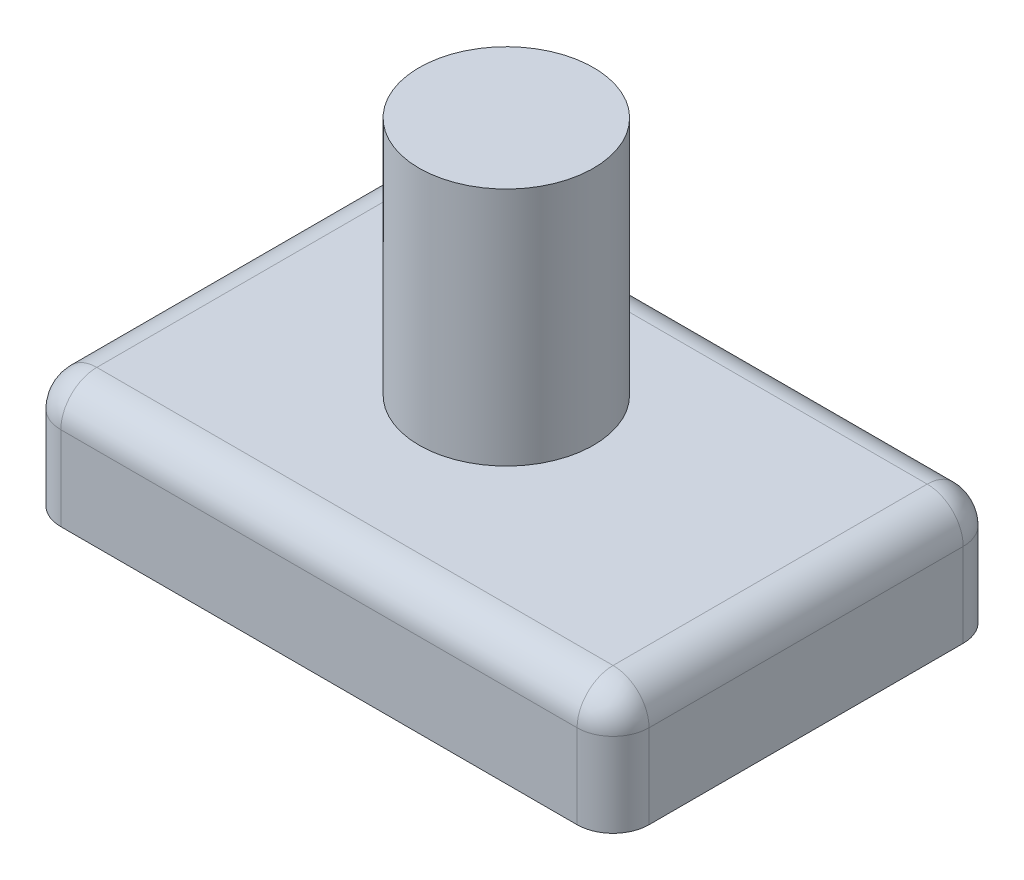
ISO-10303-21;
HEADER;
FILE_DESCRIPTION(('STEP AP214'),'2;1');
FILE_NAME('part.step','',(''),(''),'','','');
FILE_SCHEMA(('AUTOMOTIVE_DESIGN { 1 0 10303 214 1 1 1 1 }'));
ENDSEC;
DATA;
#1=APPLICATION_CONTEXT('core data for automotive mechanical design processes');
#2=APPLICATION_PROTOCOL_DEFINITION('international standard','automotive_design',2000,#1);
#3=PRODUCT_CONTEXT('',#1,'mechanical');
#4=PRODUCT('Part','Part','',(#3));
#5=PRODUCT_RELATED_PRODUCT_CATEGORY('part','',(#4));
#6=PRODUCT_DEFINITION_FORMATION('','',#4);
#7=PRODUCT_DEFINITION_CONTEXT('part definition',#1,'design');
#8=PRODUCT_DEFINITION('design','',#6,#7);
#9=PRODUCT_DEFINITION_SHAPE('','',#8);
#10=(LENGTH_UNIT() NAMED_UNIT(*) SI_UNIT(.MILLI.,.METRE.));
#11=(NAMED_UNIT(*) PLANE_ANGLE_UNIT() SI_UNIT($,.RADIAN.));
#12=(NAMED_UNIT(*) SI_UNIT($,.STERADIAN.) SOLID_ANGLE_UNIT());
#13=UNCERTAINTY_MEASURE_WITH_UNIT(LENGTH_MEASURE(1.E-05),#10,'distance_accuracy_value','');
#14=(GEOMETRIC_REPRESENTATION_CONTEXT(3) GLOBAL_UNCERTAINTY_ASSIGNED_CONTEXT((#13)) GLOBAL_UNIT_ASSIGNED_CONTEXT((#10,
#11,#12)) REPRESENTATION_CONTEXT('',''));
#15=CARTESIAN_POINT('',(0.,0.,0.));
#16=DIRECTION('',(0.,0.,1.));
#17=DIRECTION('',(1.,0.,0.));
#18=AXIS2_PLACEMENT_3D('',#15,#16,#17);
#19=CARTESIAN_POINT('',(-56.0242685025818,25.4,45.9254733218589));
#20=DIRECTION('',(0.,1.,0.));
#21=DIRECTION('',(0.,0.,1.));
#22=AXIS2_PLACEMENT_3D('',#19,#20,#21);
#23=PLANE('',#22);
#24=DIRECTION('',(-1.,0.,0.));
#25=VECTOR('',#24,1.);
#26=CARTESIAN_POINT('',(-48.4042685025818,25.4,-28.206678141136));
#27=LINE('',#26,#25);
#28=CARTESIAN_POINT('',(60.9075387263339,25.4,-28.206678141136));
#29=VERTEX_POINT('',#28);
#30=CARTESIAN_POINT('',(-48.4042685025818,25.4,-28.206678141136));
#31=VERTEX_POINT('',#30);
#32=EDGE_CURVE('E166',#29,#31,#27,.T.);
#33=ORIENTED_EDGE('',*,*,#32,.T.);
#34=DIRECTION('',(0.,0.,1.));
#35=VECTOR('',#34,1.);
#36=CARTESIAN_POINT('',(-48.4042685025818,25.4,38.3054733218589));
#37=LINE('',#36,#35);
#38=CARTESIAN_POINT('',(-48.4042685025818,25.4,38.3054733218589));
#39=VERTEX_POINT('',#38);
#40=EDGE_CURVE('E168',#31,#39,#37,.T.);
#41=ORIENTED_EDGE('',*,*,#40,.T.);
#42=DIRECTION('',(1.,0.,0.));
#43=VECTOR('',#42,1.);
#44=CARTESIAN_POINT('',(60.9075387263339,25.4,38.3054733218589));
#45=LINE('',#44,#43);
#46=CARTESIAN_POINT('',(60.9075387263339,25.4,38.3054733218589));
#47=VERTEX_POINT('',#46);
#48=EDGE_CURVE('E162',#39,#47,#45,.T.);
#49=ORIENTED_EDGE('',*,*,#48,.T.);
#50=DIRECTION('',(0.,0.,-1.));
#51=VECTOR('',#50,1.);
#52=CARTESIAN_POINT('',(60.9075387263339,25.4,-28.206678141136));
#53=LINE('',#52,#51);
#54=EDGE_CURVE('E164',#47,#29,#53,.T.);
#55=ORIENTED_EDGE('',*,*,#54,.T.);
#56=EDGE_LOOP('',(#33,#41,#49,#55));
#57=FACE_BOUND('',#56,.T.);
#58=CARTESIAN_POINT('',(0.,25.4,0.));
#59=DIRECTION('',(0.,1.,0.));
#60=DIRECTION('',(0.,0.,1.));
#61=AXIS2_PLACEMENT_3D('',#58,#59,#60);
#62=CIRCLE('',#61,18.4625705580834);
#63=CARTESIAN_POINT('',(0.,25.4,18.4625705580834));
#64=VERTEX_POINT('',#63);
#65=EDGE_CURVE('E246',#64,#64,#62,.T.);
#66=ORIENTED_EDGE('',*,*,#65,.F.);
#67=EDGE_LOOP('',(#66));
#68=FACE_BOUND('',#67,.T.);
#69=ADVANCED_FACE('F33',(#57,#68),#23,.T.);
#70=CARTESIAN_POINT('',(-56.0242685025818,25.4,-35.826678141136));
#71=DIRECTION('',(1.,0.,0.));
#72=DIRECTION('',(0.,0.,-1.));
#73=AXIS2_PLACEMENT_3D('',#70,#71,#72);
#74=PLANE('',#73);
#75=DIRECTION('',(0.,-1.,0.));
#76=VECTOR('',#75,1.);
#77=CARTESIAN_POINT('',(-56.0242685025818,25.4,38.3054733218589));
#78=LINE('',#77,#76);
#79=CARTESIAN_POINT('',(-56.0242685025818,0.,38.3054733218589));
#80=VERTEX_POINT('',#79);
#81=CARTESIAN_POINT('',(-56.0242685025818,17.78,38.3054733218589));
#82=VERTEX_POINT('',#81);
#83=EDGE_CURVE('E154',#80,#82,#78,.F.);
#84=ORIENTED_EDGE('',*,*,#83,.T.);
#85=DIRECTION('',(0.,0.,1.));
#86=VECTOR('',#85,1.);
#87=CARTESIAN_POINT('',(-56.0242685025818,17.78,-28.206678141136));
#88=LINE('',#87,#86);
#89=CARTESIAN_POINT('',(-56.0242685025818,17.78,-28.206678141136));
#90=VERTEX_POINT('',#89);
#91=EDGE_CURVE('E171',#82,#90,#88,.F.);
#92=ORIENTED_EDGE('',*,*,#91,.T.);
#93=DIRECTION('',(0.,-1.,0.));
#94=VECTOR('',#93,1.);
#95=CARTESIAN_POINT('',(-56.0242685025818,25.4,-28.206678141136));
#96=LINE('',#95,#94);
#97=CARTESIAN_POINT('',(-56.0242685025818,0.,-28.206678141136));
#98=VERTEX_POINT('',#97);
#99=EDGE_CURVE('E157',#90,#98,#96,.T.);
#100=ORIENTED_EDGE('',*,*,#99,.T.);
#101=DIRECTION('',(0.,0.,1.));
#102=VECTOR('',#101,1.);
#103=CARTESIAN_POINT('',(-56.0242685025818,0.,-35.826678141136));
#104=LINE('',#103,#102);
#105=EDGE_CURVE('E252',#98,#80,#104,.T.);
#106=ORIENTED_EDGE('',*,*,#105,.T.);
#107=EDGE_LOOP('',(#84,#92,#100,#106));
#108=FACE_BOUND('',#107,.T.);
#109=ADVANCED_FACE('F35',(#108),#74,.F.);
#110=CARTESIAN_POINT('',(-56.0242685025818,25.4,45.9254733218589));
#111=DIRECTION('',(0.,0.,-1.));
#112=DIRECTION('',(-1.,0.,0.));
#113=AXIS2_PLACEMENT_3D('',#110,#111,#112);
#114=PLANE('',#113);
#115=DIRECTION('',(0.,-1.,0.));
#116=VECTOR('',#115,1.);
#117=CARTESIAN_POINT('',(60.9075387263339,25.4,45.9254733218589));
#118=LINE('',#117,#116);
#119=CARTESIAN_POINT('',(60.9075387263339,0.,45.9254733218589));
#120=VERTEX_POINT('',#119);
#121=CARTESIAN_POINT('',(60.9075387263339,17.78,45.9254733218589));
#122=VERTEX_POINT('',#121);
#123=EDGE_CURVE('E152',#120,#122,#118,.F.);
#124=ORIENTED_EDGE('',*,*,#123,.T.);
#125=DIRECTION('',(1.,0.,0.));
#126=VECTOR('',#125,1.);
#127=CARTESIAN_POINT('',(-48.4042685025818,17.78,45.9254733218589));
#128=LINE('',#127,#126);
#129=CARTESIAN_POINT('',(-48.4042685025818,17.78,45.9254733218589));
#130=VERTEX_POINT('',#129);
#131=EDGE_CURVE('E11',#122,#130,#128,.F.);
#132=ORIENTED_EDGE('',*,*,#131,.T.);
#133=DIRECTION('',(0.,-1.,0.));
#134=VECTOR('',#133,1.);
#135=CARTESIAN_POINT('',(-48.4042685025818,25.4,45.9254733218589));
#136=LINE('',#135,#134);
#137=CARTESIAN_POINT('',(-48.4042685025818,0.,45.9254733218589));
#138=VERTEX_POINT('',#137);
#139=EDGE_CURVE('E150',#130,#138,#136,.T.);
#140=ORIENTED_EDGE('',*,*,#139,.T.);
#141=DIRECTION('',(1.,0.,0.));
#142=VECTOR('',#141,1.);
#143=CARTESIAN_POINT('',(-56.0242685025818,0.,45.9254733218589));
#144=LINE('',#143,#142);
#145=EDGE_CURVE('E141',#138,#120,#144,.T.);
#146=ORIENTED_EDGE('',*,*,#145,.T.);
#147=EDGE_LOOP('',(#124,#132,#140,#146));
#148=FACE_BOUND('',#147,.T.);
#149=ADVANCED_FACE('F213',(#148),#114,.F.);
#150=CARTESIAN_POINT('',(68.5275387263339,25.4,-35.826678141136));
#151=DIRECTION('',(-1.,0.,0.));
#152=DIRECTION('',(0.,0.,1.));
#153=AXIS2_PLACEMENT_3D('',#150,#151,#152);
#154=PLANE('',#153);
#155=DIRECTION('',(0.,-1.,0.));
#156=VECTOR('',#155,1.);
#157=CARTESIAN_POINT('',(68.5275387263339,25.4,-28.206678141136));
#158=LINE('',#157,#156);
#159=CARTESIAN_POINT('',(68.5275387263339,0.,-28.206678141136));
#160=VERTEX_POINT('',#159);
#161=CARTESIAN_POINT('',(68.5275387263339,17.78,-28.206678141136));
#162=VERTEX_POINT('',#161);
#163=EDGE_CURVE('E127',#160,#162,#158,.F.);
#164=ORIENTED_EDGE('',*,*,#163,.T.);
#165=DIRECTION('',(0.,0.,-1.));
#166=VECTOR('',#165,1.);
#167=CARTESIAN_POINT('',(68.5275387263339,17.78,38.3054733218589));
#168=LINE('',#167,#166);
#169=CARTESIAN_POINT('',(68.5275387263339,17.78,38.3054733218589));
#170=VERTEX_POINT('',#169);
#171=EDGE_CURVE('E55',#162,#170,#168,.F.);
#172=ORIENTED_EDGE('',*,*,#171,.T.);
#173=DIRECTION('',(0.,-1.,0.));
#174=VECTOR('',#173,1.);
#175=CARTESIAN_POINT('',(68.5275387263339,25.4,38.3054733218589));
#176=LINE('',#175,#174);
#177=CARTESIAN_POINT('',(68.5275387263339,0.,38.3054733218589));
#178=VERTEX_POINT('',#177);
#179=EDGE_CURVE('E131',#170,#178,#176,.T.);
#180=ORIENTED_EDGE('',*,*,#179,.T.);
#181=DIRECTION('',(0.,0.,-1.));
#182=VECTOR('',#181,1.);
#183=CARTESIAN_POINT('',(68.5275387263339,0.,-35.826678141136));
#184=LINE('',#183,#182);
#185=EDGE_CURVE('E138',#178,#160,#184,.T.);
#186=ORIENTED_EDGE('',*,*,#185,.T.);
#187=EDGE_LOOP('',(#164,#172,#180,#186));
#188=FACE_BOUND('',#187,.T.);
#189=ADVANCED_FACE('F182',(#188),#154,.F.);
#190=CARTESIAN_POINT('',(-56.0242685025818,25.4,-35.826678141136));
#191=DIRECTION('',(0.,0.,1.));
#192=DIRECTION('',(1.,0.,0.));
#193=AXIS2_PLACEMENT_3D('',#190,#191,#192);
#194=PLANE('',#193);
#195=DIRECTION('',(0.,-1.,0.));
#196=VECTOR('',#195,1.);
#197=CARTESIAN_POINT('',(-48.4042685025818,25.4,-35.826678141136));
#198=LINE('',#197,#196);
#199=CARTESIAN_POINT('',(-48.4042685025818,0.,-35.826678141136));
#200=VERTEX_POINT('',#199);
#201=CARTESIAN_POINT('',(-48.4042685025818,17.78,-35.826678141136));
#202=VERTEX_POINT('',#201);
#203=EDGE_CURVE('E122',#200,#202,#198,.F.);
#204=ORIENTED_EDGE('',*,*,#203,.T.);
#205=DIRECTION('',(-1.,0.,0.));
#206=VECTOR('',#205,1.);
#207=CARTESIAN_POINT('',(60.9075387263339,17.78,-35.826678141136));
#208=LINE('',#207,#206);
#209=CARTESIAN_POINT('',(60.9075387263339,17.78,-35.826678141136));
#210=VERTEX_POINT('',#209);
#211=EDGE_CURVE('E118',#202,#210,#208,.F.);
#212=ORIENTED_EDGE('',*,*,#211,.T.);
#213=DIRECTION('',(0.,-1.,0.));
#214=VECTOR('',#213,1.);
#215=CARTESIAN_POINT('',(60.9075387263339,25.4,-35.826678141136));
#216=LINE('',#215,#214);
#217=CARTESIAN_POINT('',(60.9075387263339,0.,-35.826678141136));
#218=VERTEX_POINT('',#217);
#219=EDGE_CURVE('E110',#210,#218,#216,.T.);
#220=ORIENTED_EDGE('',*,*,#219,.T.);
#221=DIRECTION('',(-1.,0.,0.));
#222=VECTOR('',#221,1.);
#223=CARTESIAN_POINT('',(-56.0242685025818,0.,-35.826678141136));
#224=LINE('',#223,#222);
#225=EDGE_CURVE('E115',#218,#200,#224,.T.);
#226=ORIENTED_EDGE('',*,*,#225,.T.);
#227=EDGE_LOOP('',(#204,#212,#220,#226));
#228=FACE_BOUND('',#227,.T.);
#229=ADVANCED_FACE('F113',(#228),#194,.F.);
#230=CARTESIAN_POINT('',(-56.0242685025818,0.,45.9254733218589));
#231=DIRECTION('',(0.,1.,0.));
#232=DIRECTION('',(0.,0.,1.));
#233=AXIS2_PLACEMENT_3D('',#230,#231,#232);
#234=PLANE('',#233);
#235=ORIENTED_EDGE('',*,*,#225,.F.);
#236=CARTESIAN_POINT('',(60.9075387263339,0.,-28.206678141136));
#237=DIRECTION('',(0.,1.,0.));
#238=DIRECTION('',(0.,0.,1.));
#239=AXIS2_PLACEMENT_3D('',#236,#237,#238);
#240=CIRCLE('',#239,7.62);
#241=EDGE_CURVE('E125',#218,#160,#240,.F.);
#242=ORIENTED_EDGE('',*,*,#241,.T.);
#243=ORIENTED_EDGE('',*,*,#185,.F.);
#244=CARTESIAN_POINT('',(60.9075387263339,0.,38.3054733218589));
#245=DIRECTION('',(0.,1.,0.));
#246=DIRECTION('',(0.,0.,1.));
#247=AXIS2_PLACEMENT_3D('',#244,#245,#246);
#248=CIRCLE('',#247,7.62);
#249=EDGE_CURVE('E132',#178,#120,#248,.F.);
#250=ORIENTED_EDGE('',*,*,#249,.T.);
#251=ORIENTED_EDGE('',*,*,#145,.F.);
#252=CARTESIAN_POINT('',(-48.4042685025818,0.,38.3054733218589));
#253=DIRECTION('',(0.,1.,0.));
#254=DIRECTION('',(0.,0.,1.));
#255=AXIS2_PLACEMENT_3D('',#252,#253,#254);
#256=CIRCLE('',#255,7.62);
#257=EDGE_CURVE('E121',#138,#80,#256,.F.);
#258=ORIENTED_EDGE('',*,*,#257,.T.);
#259=ORIENTED_EDGE('',*,*,#105,.F.);
#260=CARTESIAN_POINT('',(-48.4042685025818,0.,-28.206678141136));
#261=DIRECTION('',(0.,1.,0.));
#262=DIRECTION('',(0.,0.,1.));
#263=AXIS2_PLACEMENT_3D('',#260,#261,#262);
#264=CIRCLE('',#263,7.62);
#265=EDGE_CURVE('E137',#98,#200,#264,.F.);
#266=ORIENTED_EDGE('',*,*,#265,.T.);
#267=EDGE_LOOP('',(#235,#242,#243,#250,#251,#258,#259,#266));
#268=FACE_BOUND('',#267,.T.);
#269=ADVANCED_FACE('F134',(#268),#234,.F.);
#270=CARTESIAN_POINT('',(0.,76.2,0.));
#271=DIRECTION('',(0.,-1.,0.));
#272=DIRECTION('',(0.,0.,-1.));
#273=AXIS2_PLACEMENT_3D('',#270,#271,#272);
#274=CYLINDRICAL_SURFACE('',#273,18.4625705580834);
#275=CARTESIAN_POINT('',(0.,76.2,0.));
#276=DIRECTION('',(0.,1.,0.));
#277=DIRECTION('',(0.,0.,1.));
#278=AXIS2_PLACEMENT_3D('',#275,#276,#277);
#279=CIRCLE('',#278,18.4625705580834);
#280=CARTESIAN_POINT('',(0.,76.2,18.4625705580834));
#281=VERTEX_POINT('',#280);
#282=EDGE_CURVE('E249',#281,#281,#279,.T.);
#283=ORIENTED_EDGE('',*,*,#282,.F.);
#284=EDGE_LOOP('',(#283));
#285=FACE_BOUND('',#284,.T.);
#286=ORIENTED_EDGE('',*,*,#65,.T.);
#287=EDGE_LOOP('',(#286));
#288=FACE_BOUND('',#287,.T.);
#289=ADVANCED_FACE('F297',(#285,#288),#274,.T.);
#290=CARTESIAN_POINT('',(0.,76.2,0.));
#291=DIRECTION('',(0.,1.,0.));
#292=DIRECTION('',(0.,0.,1.));
#293=AXIS2_PLACEMENT_3D('',#290,#291,#292);
#294=PLANE('',#293);
#295=ORIENTED_EDGE('',*,*,#282,.T.);
#296=EDGE_LOOP('',(#295));
#297=FACE_BOUND('',#296,.T.);
#298=ADVANCED_FACE('F262',(#297),#294,.T.);
#299=CARTESIAN_POINT('',(60.9075387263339,25.4,-28.206678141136));
#300=DIRECTION('',(0.,-1.,0.));
#301=DIRECTION('',(0.,0.,-1.));
#302=AXIS2_PLACEMENT_3D('',#299,#300,#301);
#303=CYLINDRICAL_SURFACE('',#302,7.62);
#304=ORIENTED_EDGE('',*,*,#219,.F.);
#305=CARTESIAN_POINT('',(60.9075387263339,17.78,-28.206678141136));
#306=DIRECTION('',(0.,-1.,0.));
#307=DIRECTION('',(0.,0.,-1.));
#308=AXIS2_PLACEMENT_3D('',#305,#306,#307);
#309=CIRCLE('',#308,7.62);
#310=EDGE_CURVE('E176',#210,#162,#309,.T.);
#311=ORIENTED_EDGE('',*,*,#310,.T.);
#312=ORIENTED_EDGE('',*,*,#163,.F.);
#313=ORIENTED_EDGE('',*,*,#241,.F.);
#314=EDGE_LOOP('',(#304,#311,#312,#313));
#315=FACE_BOUND('',#314,.T.);
#316=ADVANCED_FACE('F126',(#315),#303,.T.);
#317=CARTESIAN_POINT('',(60.9075387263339,25.4,38.3054733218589));
#318=DIRECTION('',(0.,-1.,0.));
#319=DIRECTION('',(0.,0.,-1.));
#320=AXIS2_PLACEMENT_3D('',#317,#318,#319);
#321=CYLINDRICAL_SURFACE('',#320,7.62);
#322=ORIENTED_EDGE('',*,*,#179,.F.);
#323=CARTESIAN_POINT('',(60.9075387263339,17.78,38.3054733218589));
#324=DIRECTION('',(0.,-1.,0.));
#325=DIRECTION('',(0.,0.,-1.));
#326=AXIS2_PLACEMENT_3D('',#323,#324,#325);
#327=CIRCLE('',#326,7.62);
#328=EDGE_CURVE('E41',#170,#122,#327,.T.);
#329=ORIENTED_EDGE('',*,*,#328,.T.);
#330=ORIENTED_EDGE('',*,*,#123,.F.);
#331=ORIENTED_EDGE('',*,*,#249,.F.);
#332=EDGE_LOOP('',(#322,#329,#330,#331));
#333=FACE_BOUND('',#332,.T.);
#334=ADVANCED_FACE('F254',(#333),#321,.T.);
#335=CARTESIAN_POINT('',(-48.4042685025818,25.4,-28.206678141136));
#336=DIRECTION('',(0.,-1.,0.));
#337=DIRECTION('',(0.,0.,-1.));
#338=AXIS2_PLACEMENT_3D('',#335,#336,#337);
#339=CYLINDRICAL_SURFACE('',#338,7.62);
#340=ORIENTED_EDGE('',*,*,#99,.F.);
#341=CARTESIAN_POINT('',(-48.4042685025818,17.78,-28.206678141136));
#342=DIRECTION('',(0.,-1.,0.));
#343=DIRECTION('',(0.,0.,-1.));
#344=AXIS2_PLACEMENT_3D('',#341,#342,#343);
#345=CIRCLE('',#344,7.62);
#346=EDGE_CURVE('E173',#90,#202,#345,.T.);
#347=ORIENTED_EDGE('',*,*,#346,.T.);
#348=ORIENTED_EDGE('',*,*,#203,.F.);
#349=ORIENTED_EDGE('',*,*,#265,.F.);
#350=EDGE_LOOP('',(#340,#347,#348,#349));
#351=FACE_BOUND('',#350,.T.);
#352=ADVANCED_FACE('F236',(#351),#339,.T.);
#353=CARTESIAN_POINT('',(-48.4042685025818,25.4,38.3054733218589));
#354=DIRECTION('',(0.,-1.,0.));
#355=DIRECTION('',(0.,0.,-1.));
#356=AXIS2_PLACEMENT_3D('',#353,#354,#355);
#357=CYLINDRICAL_SURFACE('',#356,7.62);
#358=ORIENTED_EDGE('',*,*,#139,.F.);
#359=CARTESIAN_POINT('',(-48.4042685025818,17.78,38.3054733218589));
#360=DIRECTION('',(0.,-1.,0.));
#361=DIRECTION('',(0.,0.,-1.));
#362=AXIS2_PLACEMENT_3D('',#359,#360,#361);
#363=CIRCLE('',#362,7.62);
#364=EDGE_CURVE('E159',#130,#82,#363,.T.);
#365=ORIENTED_EDGE('',*,*,#364,.T.);
#366=ORIENTED_EDGE('',*,*,#83,.F.);
#367=ORIENTED_EDGE('',*,*,#257,.F.);
#368=EDGE_LOOP('',(#358,#365,#366,#367));
#369=FACE_BOUND('',#368,.T.);
#370=ADVANCED_FACE('F218',(#369),#357,.T.);
#371=CARTESIAN_POINT('',(60.9075387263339,17.78,-28.206678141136));
#372=DIRECTION('',(0.,0.,1.));
#373=DIRECTION('',(1.,0.,0.));
#374=AXIS2_PLACEMENT_3D('',#371,#372,#373);
#375=SPHERICAL_SURFACE('',#374,7.62);
#376=CARTESIAN_POINT('',(60.9075387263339,17.78,-28.206678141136));
#377=DIRECTION('',(0.,0.,1.));
#378=DIRECTION('',(1.,0.,0.));
#379=AXIS2_PLACEMENT_3D('',#376,#377,#378);
#380=CIRCLE('',#379,7.62);
#381=EDGE_CURVE('E184',#162,#29,#380,.T.);
#382=ORIENTED_EDGE('',*,*,#381,.F.);
#383=ORIENTED_EDGE('',*,*,#310,.F.);
#384=CARTESIAN_POINT('',(60.9075387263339,17.78,-28.206678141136));
#385=DIRECTION('',(-1.,0.,0.));
#386=DIRECTION('',(0.,0.,1.));
#387=AXIS2_PLACEMENT_3D('',#384,#385,#386);
#388=CIRCLE('',#387,7.62);
#389=EDGE_CURVE('E186',#29,#210,#388,.T.);
#390=ORIENTED_EDGE('',*,*,#389,.F.);
#391=EDGE_LOOP('',(#382,#383,#390));
#392=FACE_BOUND('',#391,.T.);
#393=ADVANCED_FACE('F185',(#392),#375,.T.);
#394=CARTESIAN_POINT('',(-56.0242685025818,17.78,-28.206678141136));
#395=DIRECTION('',(1.,0.,0.));
#396=DIRECTION('',(0.,0.,-1.));
#397=AXIS2_PLACEMENT_3D('',#394,#395,#396);
#398=CYLINDRICAL_SURFACE('',#397,7.62);
#399=ORIENTED_EDGE('',*,*,#389,.T.);
#400=ORIENTED_EDGE('',*,*,#211,.F.);
#401=CARTESIAN_POINT('',(-48.4042685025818,17.78,-28.206678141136));
#402=DIRECTION('',(-1.,0.,0.));
#403=DIRECTION('',(0.,0.,1.));
#404=AXIS2_PLACEMENT_3D('',#401,#402,#403);
#405=CIRCLE('',#404,7.62);
#406=EDGE_CURVE('E190',#31,#202,#405,.T.);
#407=ORIENTED_EDGE('',*,*,#406,.F.);
#408=ORIENTED_EDGE('',*,*,#32,.F.);
#409=EDGE_LOOP('',(#399,#400,#407,#408));
#410=FACE_BOUND('',#409,.T.);
#411=ADVANCED_FACE('F340',(#410),#398,.T.);
#412=CARTESIAN_POINT('',(60.9075387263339,17.78,45.9254733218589));
#413=DIRECTION('',(0.,0.,1.));
#414=DIRECTION('',(1.,0.,0.));
#415=AXIS2_PLACEMENT_3D('',#412,#413,#414);
#416=CYLINDRICAL_SURFACE('',#415,7.62);
#417=ORIENTED_EDGE('',*,*,#381,.T.);
#418=ORIENTED_EDGE('',*,*,#54,.F.);
#419=CARTESIAN_POINT('',(60.9075387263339,17.78,38.3054733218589));
#420=DIRECTION('',(0.,0.,1.));
#421=DIRECTION('',(1.,0.,0.));
#422=AXIS2_PLACEMENT_3D('',#419,#420,#421);
#423=CIRCLE('',#422,7.62);
#424=EDGE_CURVE('E195',#170,#47,#423,.T.);
#425=ORIENTED_EDGE('',*,*,#424,.F.);
#426=ORIENTED_EDGE('',*,*,#171,.F.);
#427=EDGE_LOOP('',(#417,#418,#425,#426));
#428=FACE_BOUND('',#427,.T.);
#429=ADVANCED_FACE('F193',(#428),#416,.T.);
#430=CARTESIAN_POINT('',(-48.4042685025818,17.78,-28.206678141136));
#431=DIRECTION('',(0.,0.,1.));
#432=DIRECTION('',(1.,0.,0.));
#433=AXIS2_PLACEMENT_3D('',#430,#431,#432);
#434=SPHERICAL_SURFACE('',#433,7.62);
#435=ORIENTED_EDGE('',*,*,#406,.T.);
#436=ORIENTED_EDGE('',*,*,#346,.F.);
#437=CARTESIAN_POINT('',(-48.4042685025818,17.78,-28.206678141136));
#438=DIRECTION('',(0.,0.,1.));
#439=DIRECTION('',(1.,0.,0.));
#440=AXIS2_PLACEMENT_3D('',#437,#438,#439);
#441=CIRCLE('',#440,7.62);
#442=EDGE_CURVE('E199',#31,#90,#441,.T.);
#443=ORIENTED_EDGE('',*,*,#442,.F.);
#444=EDGE_LOOP('',(#435,#436,#443));
#445=FACE_BOUND('',#444,.T.);
#446=ADVANCED_FACE('F239',(#445),#434,.T.);
#447=CARTESIAN_POINT('',(60.9075387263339,17.78,38.3054733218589));
#448=DIRECTION('',(0.,0.,1.));
#449=DIRECTION('',(1.,0.,0.));
#450=AXIS2_PLACEMENT_3D('',#447,#448,#449);
#451=SPHERICAL_SURFACE('',#450,7.62);
#452=ORIENTED_EDGE('',*,*,#328,.F.);
#453=ORIENTED_EDGE('',*,*,#424,.T.);
#454=CARTESIAN_POINT('',(60.9075387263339,17.78,38.3054733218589));
#455=DIRECTION('',(-1.,0.,0.));
#456=DIRECTION('',(0.,0.,1.));
#457=AXIS2_PLACEMENT_3D('',#454,#455,#456);
#458=CIRCLE('',#457,7.62);
#459=EDGE_CURVE('E202',#122,#47,#458,.T.);
#460=ORIENTED_EDGE('',*,*,#459,.F.);
#461=EDGE_LOOP('',(#452,#453,#460));
#462=FACE_BOUND('',#461,.T.);
#463=ADVANCED_FACE('F201',(#462),#451,.T.);
#464=CARTESIAN_POINT('',(-48.4042685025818,17.78,45.9254733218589));
#465=DIRECTION('',(0.,0.,-1.));
#466=DIRECTION('',(-1.,0.,0.));
#467=AXIS2_PLACEMENT_3D('',#464,#465,#466);
#468=CYLINDRICAL_SURFACE('',#467,7.62);
#469=ORIENTED_EDGE('',*,*,#442,.T.);
#470=ORIENTED_EDGE('',*,*,#91,.F.);
#471=CARTESIAN_POINT('',(-48.4042685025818,17.78,38.3054733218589));
#472=DIRECTION('',(0.,0.,1.));
#473=DIRECTION('',(1.,0.,0.));
#474=AXIS2_PLACEMENT_3D('',#471,#472,#473);
#475=CIRCLE('',#474,7.62);
#476=EDGE_CURVE('E206',#39,#82,#475,.T.);
#477=ORIENTED_EDGE('',*,*,#476,.F.);
#478=ORIENTED_EDGE('',*,*,#40,.F.);
#479=EDGE_LOOP('',(#469,#470,#477,#478));
#480=FACE_BOUND('',#479,.T.);
#481=ADVANCED_FACE('F229',(#480),#468,.T.);
#482=CARTESIAN_POINT('',(-56.0242685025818,17.78,38.3054733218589));
#483=DIRECTION('',(-1.,0.,0.));
#484=DIRECTION('',(0.,0.,1.));
#485=AXIS2_PLACEMENT_3D('',#482,#483,#484);
#486=CYLINDRICAL_SURFACE('',#485,7.62);
#487=ORIENTED_EDGE('',*,*,#459,.T.);
#488=ORIENTED_EDGE('',*,*,#48,.F.);
#489=CARTESIAN_POINT('',(-48.4042685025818,17.78,38.3054733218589));
#490=DIRECTION('',(-1.,0.,0.));
#491=DIRECTION('',(0.,0.,1.));
#492=AXIS2_PLACEMENT_3D('',#489,#490,#491);
#493=CIRCLE('',#492,7.62);
#494=EDGE_CURVE('E210',#130,#39,#493,.T.);
#495=ORIENTED_EDGE('',*,*,#494,.F.);
#496=ORIENTED_EDGE('',*,*,#131,.F.);
#497=EDGE_LOOP('',(#487,#488,#495,#496));
#498=FACE_BOUND('',#497,.T.);
#499=ADVANCED_FACE('F209',(#498),#486,.T.);
#500=CARTESIAN_POINT('',(-48.4042685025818,17.78,38.3054733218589));
#501=DIRECTION('',(0.,0.,1.));
#502=DIRECTION('',(1.,0.,0.));
#503=AXIS2_PLACEMENT_3D('',#500,#501,#502);
#504=SPHERICAL_SURFACE('',#503,7.62);
#505=ORIENTED_EDGE('',*,*,#476,.T.);
#506=ORIENTED_EDGE('',*,*,#364,.F.);
#507=ORIENTED_EDGE('',*,*,#494,.T.);
#508=EDGE_LOOP('',(#505,#506,#507));
#509=FACE_BOUND('',#508,.T.);
#510=ADVANCED_FACE('F222',(#509),#504,.T.);
#511=CLOSED_SHELL('',(#69,#109,#149,#189,#229,#269,#289,#298,#316,#334,#352,#370,#393,#411,#429,
#446,#463,#481,#499,#510));
#512=MANIFOLD_SOLID_BREP('B2',#511);
#513=ADVANCED_BREP_SHAPE_REPRESENTATION('',(#18,#512),#14);
#514=SHAPE_DEFINITION_REPRESENTATION(#9,#513);
ENDSEC;
END-ISO-10303-21;
